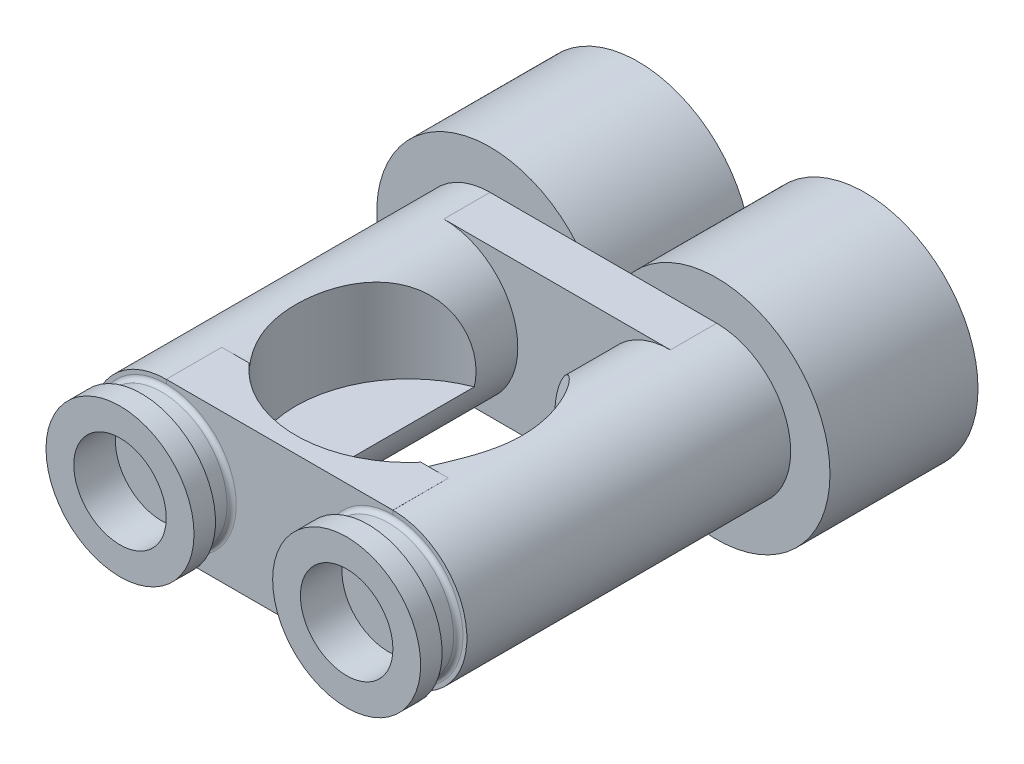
from build123d import *

# Parameters (mm, degrees)
SKIZZE1_R                       = 2.45
LINEAR_AUSTRAGEN1_DEPTH         = 3.2
SKIZZE2_R                       = 2.45
LINEAR_AUSTRAGEN2_DEPTH         = 3.2
SKIZZE3_R                       = 1.6
LINEAR_AUSTRAGEN3_DEPTH         = 8
SKIZZE6_W                       = 4.9
SKIZZE6_H                       = 3.2
LINEAR_AUSTRAGEN16_DEPTH        = 1.2
SKIZZE7_W                       = 4.9
SKIZZE7_H                       = 3.2
LINEAR_AUSTRAGEN18_DEPTH        = 1
SKIZZE8_R                       = 1
SCHNITT_LINEAR_AUSTRAGEN1_DEPTH = 0.9
SKIZZE10_W                      = 0.535359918
SKIZZE10_H                      = 0.186203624
VERRUNDUNG1_R                   = 0.1
SKIZZE11_W                      = 0.535359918
SKIZZE11_H                      = 0.186203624
VERRUNDUNG2_R                   = 0.1
SKIZZE12_R                      = 2.45
SCHNITT_LINEAR_AUSTRAGEN2_DEPTH = 1.9


with BuildPart() as part:
    # Skizze1 → Linear austragen1 (new body)
    with BuildSketch(Plane.XY):
        Circle(SKIZZE1_R)
    extrude(amount=LINEAR_AUSTRAGEN1_DEPTH)



with BuildPart() as body_2:
    # Skizze2 → Linear austragen2 (new body)
    with BuildSketch(Plane.XY.offset(3.2)):
        with Locations((4.9, 0)):
            Circle(SKIZZE2_R)
    extrude(amount=-LINEAR_AUSTRAGEN2_DEPTH)


with BuildPart() as part_1:
    add(part.part)

    add(body_2.part)  # Linear austragen3 merges body 2
    # Skizze3 → Linear austragen3 (add)
    with BuildSketch(Plane.XY.offset(3.2)):
        Circle(SKIZZE3_R)
        with Locations((4.9, 0)):
            Circle(SKIZZE3_R)
    extrude(amount=LINEAR_AUSTRAGEN3_DEPTH)

    # Skizze8 → Schnitt-Linear austragen1 (cut)
    with BuildSketch(Plane.XY.offset(11.2)):
        Circle(SKIZZE8_R)
        with Locations((4.9, 0)):
            Circle(SKIZZE8_R)
    extrude(amount=-SCHNITT_LINEAR_AUSTRAGEN1_DEPTH, mode=Mode.SUBTRACT)

    # Skizze10 → Schnitt-Rotation1 (revolve, cut)
    with BuildSketch(Plane(origin=(0, 0, 0), x_dir=(0, 0, -1), z_dir=(1, 0, 0)), mode=Mode.PRIVATE) as schnitt_rotation1_sk:
        with Locations((-10.467679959, 1.506898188)):
            Rectangle(SKIZZE10_W, SKIZZE10_H)
    revolve(schnitt_rotation1_sk.sketch.rotate(Axis((0, 0, 0), (0, 0, 1)), 90), axis=Axis((0, 0, 0), (0, 0, 1)), mode=Mode.SUBTRACT)

    # Verrundung1
    verrundung1_edges = [part_1.edges().sort_by_distance(p)[0] for p in [
        (1.413796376, 0, 10.2),
        (1.413796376, 0, 10.735359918),
    ]]
    fillet(verrundung1_edges, radius=VERRUNDUNG1_R)

    # Skizze11 → Schnitt-Rotation2 (revolve, cut)
    with BuildSketch(Plane(origin=(4.9, 0, 0), x_dir=(0, 0, -1), z_dir=(1, 0, 0)), mode=Mode.PRIVATE) as schnitt_rotation2_sk:
        with Locations((-10.467679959, 1.506898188)):
            Rectangle(SKIZZE11_W, SKIZZE11_H)
    revolve(schnitt_rotation2_sk.sketch.rotate(Axis((4.9, 0, 0), (0, 0, 1)), 90), axis=Axis((4.9, 0, 0), (0, 0, 1)), mode=Mode.SUBTRACT)

    # Verrundung2
    verrundung2_edges = [part_1.edges().sort_by_distance(p)[0] for p in [
        (6.313796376, 0, 10.735359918),
        (6.313796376, 0, 10.2),
    ]]
    fillet(verrundung2_edges, radius=VERRUNDUNG2_R)


with BuildPart() as body_2_2:
    # Skizze6 → Linear austragen16 (new body)
    with BuildSketch(Plane.XY.offset(10.2)):
        with Locations((2.45, 0)):
            Rectangle(SKIZZE6_W, SKIZZE6_H)
    extrude(amount=-LINEAR_AUSTRAGEN16_DEPTH)


with BuildPart() as body_3:
    # Skizze7 → Linear austragen18 (new body)
    with BuildSketch(Plane.XY.offset(3.2)):
        with Locations((2.45, 0)):
            Rectangle(SKIZZE7_W, SKIZZE7_H)
    extrude(amount=LINEAR_AUSTRAGEN18_DEPTH)


with BuildPart() as schnitt_linear_austragen2_tool:
    # Skizze12 → Schnitt-Linear austragen2 (new body)
    with BuildSketch(Plane(origin=(0, 1.6, 0), x_dir=(-1, 0, 0), z_dir=(0, 1, 0))):
        with Locations((-2.45, 7.4)):
            Circle(SKIZZE12_R)
    extrude(amount=-SCHNITT_LINEAR_AUSTRAGEN2_DEPTH)


with BuildPart() as part_2:
    add(part_1.part)

    # Schnitt-Linear austragen2: cut by schnitt_linear_austragen2_tool
    add(schnitt_linear_austragen2_tool.part, mode=Mode.SUBTRACT)


with BuildPart() as body_2_2_1:
    add(body_2_2.part)

    # Schnitt-Linear austragen2: cut by schnitt_linear_austragen2_tool
    add(schnitt_linear_austragen2_tool.part, mode=Mode.SUBTRACT)


solid = Compound([body_3.part, part_2.part, body_2_2_1.part])
